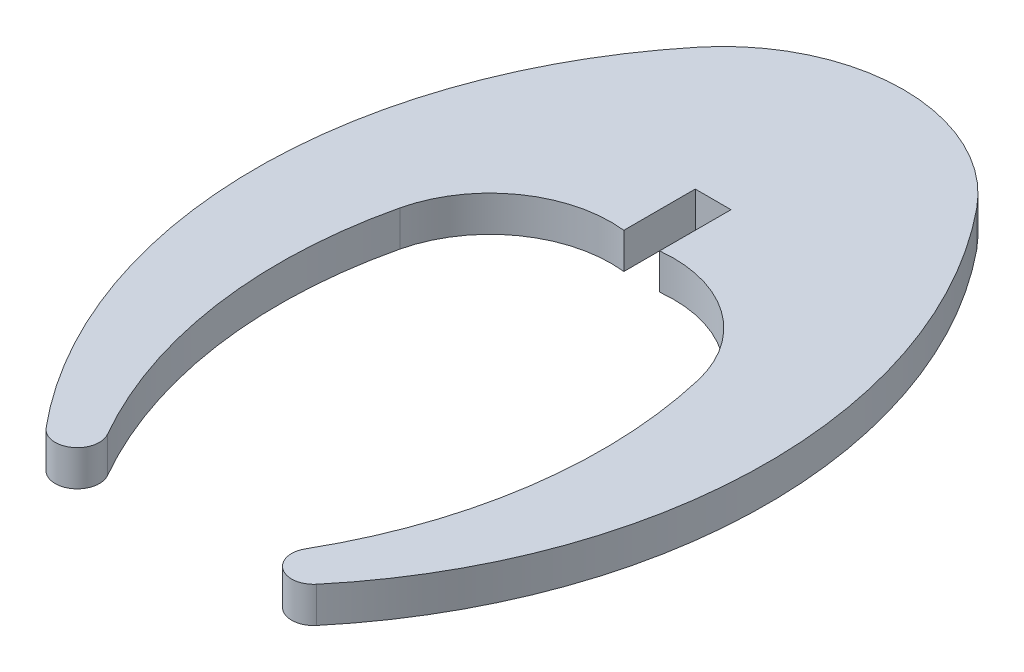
ISO-10303-21;
HEADER;
FILE_DESCRIPTION(('STEP AP214'),'2;1');
FILE_NAME('part.step','',(''),(''),'','','');
FILE_SCHEMA(('AUTOMOTIVE_DESIGN { 1 0 10303 214 1 1 1 1 }'));
ENDSEC;
DATA;
#1=APPLICATION_CONTEXT('core data for automotive mechanical design processes');
#2=APPLICATION_PROTOCOL_DEFINITION('international standard','automotive_design',2000,#1);
#3=PRODUCT_CONTEXT('',#1,'mechanical');
#4=PRODUCT('Part','Part','',(#3));
#5=PRODUCT_RELATED_PRODUCT_CATEGORY('part','',(#4));
#6=PRODUCT_DEFINITION_FORMATION('','',#4);
#7=PRODUCT_DEFINITION_CONTEXT('part definition',#1,'design');
#8=PRODUCT_DEFINITION('design','',#6,#7);
#9=PRODUCT_DEFINITION_SHAPE('','',#8);
#10=(LENGTH_UNIT() NAMED_UNIT(*) SI_UNIT(.MILLI.,.METRE.));
#11=(NAMED_UNIT(*) PLANE_ANGLE_UNIT() SI_UNIT($,.RADIAN.));
#12=(NAMED_UNIT(*) SI_UNIT($,.STERADIAN.) SOLID_ANGLE_UNIT());
#13=UNCERTAINTY_MEASURE_WITH_UNIT(LENGTH_MEASURE(1.E-05),#10,'distance_accuracy_value','');
#14=(GEOMETRIC_REPRESENTATION_CONTEXT(3) GLOBAL_UNCERTAINTY_ASSIGNED_CONTEXT((#13)) GLOBAL_UNIT_ASSIGNED_CONTEXT((#10,
#11,#12)) REPRESENTATION_CONTEXT('',''));
#15=CARTESIAN_POINT('',(0.,0.,0.));
#16=DIRECTION('',(0.,0.,1.));
#17=DIRECTION('',(1.,0.,0.));
#18=AXIS2_PLACEMENT_3D('',#15,#16,#17);
#19=CARTESIAN_POINT('',(-41923.310631,3.,-18307.5707099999));
#20=DIRECTION('',(-0.999999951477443,0.,0.000311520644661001));
#21=DIRECTION('',(0.000311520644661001,0.,0.999999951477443));
#22=AXIS2_PLACEMENT_3D('',#19,#20,#21);
#23=PLANE('',#22);
#24=DIRECTION('',(-0.000311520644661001,0.,-0.999999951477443));
#25=VECTOR('',#24,1.);
#26=CARTESIAN_POINT('',(-41923.310631,0.,-18307.5707099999));
#27=LINE('',#26,#25);
#28=CARTESIAN_POINT('',(-41923.310631,0.,-18307.5707099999));
#29=VERTEX_POINT('',#28);
#30=CARTESIAN_POINT('',(-41923.3125,0.,-18313.570312));
#31=VERTEX_POINT('',#30);
#32=EDGE_CURVE('E156',#29,#31,#27,.T.);
#33=ORIENTED_EDGE('',*,*,#32,.T.);
#34=DIRECTION('',(0.,-1.,0.));
#35=VECTOR('',#34,1.);
#36=CARTESIAN_POINT('',(-41923.3125,3.,-18313.570312));
#37=LINE('',#36,#35);
#38=CARTESIAN_POINT('',(-41923.3125,3.,-18313.570312));
#39=VERTEX_POINT('',#38);
#40=EDGE_CURVE('E11',#39,#31,#37,.T.);
#41=ORIENTED_EDGE('',*,*,#40,.F.);
#42=DIRECTION('',(-0.000311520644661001,0.,-0.999999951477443));
#43=VECTOR('',#42,1.);
#44=CARTESIAN_POINT('',(-41923.310631,3.,-18307.5707099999));
#45=LINE('',#44,#43);
#46=CARTESIAN_POINT('',(-41923.310631,3.,-18307.5707099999));
#47=VERTEX_POINT('',#46);
#48=EDGE_CURVE('E178',#47,#39,#45,.T.);
#49=ORIENTED_EDGE('',*,*,#48,.F.);
#50=DIRECTION('',(0.,-1.,0.));
#51=VECTOR('',#50,1.);
#52=CARTESIAN_POINT('',(-41923.310631,3.,-18307.5707099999));
#53=LINE('',#52,#51);
#54=EDGE_CURVE('E152',#47,#29,#53,.T.);
#55=ORIENTED_EDGE('',*,*,#54,.T.);
#56=EDGE_LOOP('',(#33,#41,#49,#55));
#57=FACE_BOUND('',#56,.T.);
#58=ADVANCED_FACE('F36',(#57),#23,.F.);
#59=CARTESIAN_POINT('',(-41923.3125,3.,-18313.570312));
#60=DIRECTION('',(0.000650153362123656,0.,-0.999999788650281));
#61=DIRECTION('',(-0.999999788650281,0.,-0.000650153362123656));
#62=AXIS2_PLACEMENT_3D('',#59,#60,#61);
#63=PLANE('',#62);
#64=DIRECTION('',(0.99999978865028,0.,0.000650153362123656));
#65=VECTOR('',#64,1.);
#66=CARTESIAN_POINT('',(-41923.3125,0.,-18313.570312));
#67=LINE('',#66,#65);
#68=CARTESIAN_POINT('',(-41920.308594,0.,-18313.568359));
#69=VERTEX_POINT('',#68);
#70=EDGE_CURVE('E159',#31,#69,#67,.T.);
#71=ORIENTED_EDGE('',*,*,#70,.T.);
#72=DIRECTION('',(0.,-1.,0.));
#73=VECTOR('',#72,1.);
#74=CARTESIAN_POINT('',(-41920.308594,3.,-18313.568359));
#75=LINE('',#74,#73);
#76=CARTESIAN_POINT('',(-41920.308594,3.,-18313.568359));
#77=VERTEX_POINT('',#76);
#78=EDGE_CURVE('E44',#77,#69,#75,.T.);
#79=ORIENTED_EDGE('',*,*,#78,.F.);
#80=DIRECTION('',(0.99999978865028,0.,0.000650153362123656));
#81=VECTOR('',#80,1.);
#82=CARTESIAN_POINT('',(-41923.3125,3.,-18313.570312));
#83=LINE('',#82,#81);
#84=EDGE_CURVE('E107',#39,#77,#83,.T.);
#85=ORIENTED_EDGE('',*,*,#84,.F.);
#86=ORIENTED_EDGE('',*,*,#40,.T.);
#87=EDGE_LOOP('',(#71,#79,#85,#86));
#88=FACE_BOUND('',#87,.T.);
#89=ADVANCED_FACE('F256',(#88),#63,.F.);
#90=CARTESIAN_POINT('',(-41920.308594,3.,-18313.568359));
#91=DIRECTION('',(0.999999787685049,0.,0.00065163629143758));
#92=DIRECTION('',(0.00065163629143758,0.,-0.999999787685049));
#93=AXIS2_PLACEMENT_3D('',#90,#91,#92);
#94=PLANE('',#93);
#95=DIRECTION('',(-0.00065163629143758,0.,0.999999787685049));
#96=VECTOR('',#95,1.);
#97=CARTESIAN_POINT('',(-41920.308594,0.,-18313.568359));
#98=LINE('',#97,#96);
#99=CARTESIAN_POINT('',(-41920.3125,0.,-18307.574219));
#100=VERTEX_POINT('',#99);
#101=EDGE_CURVE('E161',#69,#100,#98,.T.);
#102=ORIENTED_EDGE('',*,*,#101,.T.);
#103=DIRECTION('',(0.,-1.,0.));
#104=VECTOR('',#103,1.);
#105=CARTESIAN_POINT('',(-41920.3125,3.,-18307.574219));
#106=LINE('',#105,#104);
#107=CARTESIAN_POINT('',(-41920.3125,3.,-18307.574219));
#108=VERTEX_POINT('',#107);
#109=EDGE_CURVE('E197',#108,#100,#106,.T.);
#110=ORIENTED_EDGE('',*,*,#109,.F.);
#111=DIRECTION('',(-0.00065163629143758,0.,0.999999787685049));
#112=VECTOR('',#111,1.);
#113=CARTESIAN_POINT('',(-41920.308594,3.,-18313.568359));
#114=LINE('',#113,#112);
#115=EDGE_CURVE('E205',#77,#108,#114,.T.);
#116=ORIENTED_EDGE('',*,*,#115,.F.);
#117=ORIENTED_EDGE('',*,*,#78,.T.);
#118=EDGE_LOOP('',(#102,#110,#116,#117));
#119=FACE_BOUND('',#118,.T.);
#120=ADVANCED_FACE('F203',(#119),#94,.F.);
#121=CARTESIAN_POINT('',(-41919.1911014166,3.,-18297.4693434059));
#122=DIRECTION('',(0.,-1.,0.));
#123=DIRECTION('',(0.,0.,-1.));
#124=AXIS2_PLACEMENT_3D('',#121,#122,#123);
#125=CYLINDRICAL_SURFACE('',#124,10.1669093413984);
#126=CARTESIAN_POINT('',(-41919.1911014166,0.,-18297.4693434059));
#127=DIRECTION('',(0.,-1.,0.));
#128=DIRECTION('',(0.,0.,1.));
#129=AXIS2_PLACEMENT_3D('',#126,#127,#128);
#130=CIRCLE('',#129,10.1669093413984);
#131=CARTESIAN_POINT('',(-41909.2904880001,0.,-18299.781031));
#132=VERTEX_POINT('',#131);
#133=EDGE_CURVE('E163',#100,#132,#130,.T.);
#134=ORIENTED_EDGE('',*,*,#133,.T.);
#135=DIRECTION('',(0.,-1.,0.));
#136=VECTOR('',#135,1.);
#137=CARTESIAN_POINT('',(-41909.2904880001,3.,-18299.781031));
#138=LINE('',#137,#136);
#139=CARTESIAN_POINT('',(-41909.2904880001,3.,-18299.781031));
#140=VERTEX_POINT('',#139);
#141=EDGE_CURVE('E194',#140,#132,#138,.T.);
#142=ORIENTED_EDGE('',*,*,#141,.F.);
#143=CARTESIAN_POINT('',(-41919.1911014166,3.,-18297.4693434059));
#144=DIRECTION('',(0.,-1.,0.));
#145=DIRECTION('',(0.,0.,1.));
#146=AXIS2_PLACEMENT_3D('',#143,#144,#145);
#147=CIRCLE('',#146,10.1669093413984);
#148=EDGE_CURVE('E223',#108,#140,#147,.T.);
#149=ORIENTED_EDGE('',*,*,#148,.F.);
#150=ORIENTED_EDGE('',*,*,#109,.T.);
#151=EDGE_LOOP('',(#134,#142,#149,#150));
#152=FACE_BOUND('',#151,.T.);
#153=ADVANCED_FACE('F214',(#152),#125,.F.);
#154=CARTESIAN_POINT('',(-41947.8406722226,3.,-18290.7599826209));
#155=DIRECTION('',(0.,-1.,0.));
#156=DIRECTION('',(0.,0.,-1.));
#157=AXIS2_PLACEMENT_3D('',#154,#155,#156);
#158=CYLINDRICAL_SURFACE('',#157,39.5916154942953);
#159=CARTESIAN_POINT('',(-41947.8406722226,0.,-18290.7599826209));
#160=DIRECTION('',(0.,-1.,0.));
#161=DIRECTION('',(0.,0.,1.));
#162=AXIS2_PLACEMENT_3D('',#159,#160,#161);
#163=CIRCLE('',#162,39.5916154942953);
#164=CARTESIAN_POINT('',(-41913.5091370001,0.,-18271.040913));
#165=VERTEX_POINT('',#164);
#166=EDGE_CURVE('E165',#132,#165,#163,.T.);
#167=ORIENTED_EDGE('',*,*,#166,.T.);
#168=DIRECTION('',(0.,-1.,0.));
#169=VECTOR('',#168,1.);
#170=CARTESIAN_POINT('',(-41913.5091370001,3.,-18271.040913));
#171=LINE('',#170,#169);
#172=CARTESIAN_POINT('',(-41913.5091370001,3.,-18271.040913));
#173=VERTEX_POINT('',#172);
#174=EDGE_CURVE('E191',#173,#165,#171,.T.);
#175=ORIENTED_EDGE('',*,*,#174,.F.);
#176=CARTESIAN_POINT('',(-41947.8406722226,3.,-18290.7599826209));
#177=DIRECTION('',(0.,-1.,0.));
#178=DIRECTION('',(0.,0.,1.));
#179=AXIS2_PLACEMENT_3D('',#176,#177,#178);
#180=CIRCLE('',#179,39.5916154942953);
#181=EDGE_CURVE('E220',#140,#173,#180,.T.);
#182=ORIENTED_EDGE('',*,*,#181,.F.);
#183=ORIENTED_EDGE('',*,*,#141,.T.);
#184=EDGE_LOOP('',(#167,#175,#182,#183));
#185=FACE_BOUND('',#184,.T.);
#186=ADVANCED_FACE('F218',(#185),#158,.F.);
#187=CARTESIAN_POINT('',(-41911.8973565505,3.,-18270.1164332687));
#188=DIRECTION('',(0.,-1.,0.));
#189=DIRECTION('',(0.,0.,-1.));
#190=AXIS2_PLACEMENT_3D('',#187,#188,#189);
#191=CYLINDRICAL_SURFACE('',#190,1.85809014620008);
#192=CARTESIAN_POINT('',(-41911.8973565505,0.,-18270.1164332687));
#193=DIRECTION('',(0.,1.,0.));
#194=DIRECTION('',(0.,0.,1.));
#195=AXIS2_PLACEMENT_3D('',#192,#193,#194);
#196=CIRCLE('',#195,1.85809014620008);
#197=CARTESIAN_POINT('',(-41910.473192,0.,-18268.923012));
#198=VERTEX_POINT('',#197);
#199=EDGE_CURVE('E167',#165,#198,#196,.T.);
#200=ORIENTED_EDGE('',*,*,#199,.T.);
#201=DIRECTION('',(0.,-1.,0.));
#202=VECTOR('',#201,1.);
#203=CARTESIAN_POINT('',(-41910.473192,3.,-18268.923012));
#204=LINE('',#203,#202);
#205=CARTESIAN_POINT('',(-41910.473192,3.,-18268.923012));
#206=VERTEX_POINT('',#205);
#207=EDGE_CURVE('E188',#206,#198,#204,.T.);
#208=ORIENTED_EDGE('',*,*,#207,.F.);
#209=CARTESIAN_POINT('',(-41911.8973565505,3.,-18270.1164332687));
#210=DIRECTION('',(0.,1.,0.));
#211=DIRECTION('',(0.,0.,1.));
#212=AXIS2_PLACEMENT_3D('',#209,#210,#211);
#213=CIRCLE('',#212,1.85809014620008);
#214=EDGE_CURVE('E222',#173,#206,#213,.T.);
#215=ORIENTED_EDGE('',*,*,#214,.F.);
#216=ORIENTED_EDGE('',*,*,#174,.T.);
#217=EDGE_LOOP('',(#200,#208,#215,#216));
#218=FACE_BOUND('',#217,.T.);
#219=ADVANCED_FACE('F269',(#218),#191,.T.);
#220=CARTESIAN_POINT('',(-41943.5859328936,3.,-18296.6861208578));
#221=DIRECTION('',(0.,-1.,0.));
#222=DIRECTION('',(0.,0.,-1.));
#223=AXIS2_PLACEMENT_3D('',#220,#221,#222);
#224=CYLINDRICAL_SURFACE('',#223,43.2116167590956);
#225=CARTESIAN_POINT('',(-41943.5859328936,0.,-18296.6861208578));
#226=DIRECTION('',(0.,1.,0.));
#227=DIRECTION('',(0.,0.,1.));
#228=AXIS2_PLACEMENT_3D('',#225,#226,#227);
#229=CIRCLE('',#228,43.2116167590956);
#230=CARTESIAN_POINT('',(-41910.079274,0.,-18323.972521));
#231=VERTEX_POINT('',#230);
#232=EDGE_CURVE('E169',#198,#231,#229,.T.);
#233=ORIENTED_EDGE('',*,*,#232,.T.);
#234=DIRECTION('',(0.,-1.,0.));
#235=VECTOR('',#234,1.);
#236=CARTESIAN_POINT('',(-41910.079274,3.,-18323.972521));
#237=LINE('',#236,#235);
#238=CARTESIAN_POINT('',(-41910.079274,3.,-18323.972521));
#239=VERTEX_POINT('',#238);
#240=EDGE_CURVE('E185',#239,#231,#237,.T.);
#241=ORIENTED_EDGE('',*,*,#240,.F.);
#242=CARTESIAN_POINT('',(-41943.5859328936,3.,-18296.6861208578));
#243=DIRECTION('',(0.,1.,0.));
#244=DIRECTION('',(0.,0.,1.));
#245=AXIS2_PLACEMENT_3D('',#242,#243,#244);
#246=CIRCLE('',#245,43.2116167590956);
#247=EDGE_CURVE('E225',#206,#239,#246,.T.);
#248=ORIENTED_EDGE('',*,*,#247,.F.);
#249=ORIENTED_EDGE('',*,*,#207,.T.);
#250=EDGE_LOOP('',(#233,#241,#248,#249));
#251=FACE_BOUND('',#250,.T.);
#252=ADVANCED_FACE('F272',(#251),#224,.T.);
#253=CARTESIAN_POINT('',(-41921.8088364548,3.,-18314.4179691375));
#254=DIRECTION('',(0.,-1.,0.));
#255=DIRECTION('',(0.,0.,-1.));
#256=AXIS2_PLACEMENT_3D('',#253,#254,#255);
#257=CYLINDRICAL_SURFACE('',#256,15.1285193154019);
#258=CARTESIAN_POINT('',(-41921.8088364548,0.,-18314.4179691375));
#259=DIRECTION('',(0.,1.,0.));
#260=DIRECTION('',(0.,0.,1.));
#261=AXIS2_PLACEMENT_3D('',#258,#259,#260);
#262=CIRCLE('',#261,15.1285193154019);
#263=CARTESIAN_POINT('',(-41933.528271,0.,-18323.984941));
#264=VERTEX_POINT('',#263);
#265=EDGE_CURVE('E171',#231,#264,#262,.T.);
#266=ORIENTED_EDGE('',*,*,#265,.T.);
#267=DIRECTION('',(0.,-1.,0.));
#268=VECTOR('',#267,1.);
#269=CARTESIAN_POINT('',(-41933.528271,3.,-18323.984941));
#270=LINE('',#269,#268);
#271=CARTESIAN_POINT('',(-41933.528271,3.,-18323.984941));
#272=VERTEX_POINT('',#271);
#273=EDGE_CURVE('E182',#272,#264,#270,.T.);
#274=ORIENTED_EDGE('',*,*,#273,.F.);
#275=CARTESIAN_POINT('',(-41921.8088364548,3.,-18314.4179691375));
#276=DIRECTION('',(0.,1.,0.));
#277=DIRECTION('',(0.,0.,1.));
#278=AXIS2_PLACEMENT_3D('',#275,#276,#277);
#279=CIRCLE('',#278,15.1285193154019);
#280=EDGE_CURVE('E231',#239,#272,#279,.T.);
#281=ORIENTED_EDGE('',*,*,#280,.F.);
#282=ORIENTED_EDGE('',*,*,#240,.T.);
#283=EDGE_LOOP('',(#266,#274,#281,#282));
#284=FACE_BOUND('',#283,.T.);
#285=ADVANCED_FACE('F237',(#284),#257,.T.);
#286=CARTESIAN_POINT('',(-41900.0507753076,3.,-18296.6631295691));
#287=DIRECTION('',(0.,-1.,0.));
#288=DIRECTION('',(0.,0.,-1.));
#289=AXIS2_PLACEMENT_3D('',#286,#287,#288);
#290=CYLINDRICAL_SURFACE('',#289,43.2113885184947);
#291=CARTESIAN_POINT('',(-41900.0507753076,0.,-18296.6631295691));
#292=DIRECTION('',(0.,1.,0.));
#293=DIRECTION('',(0.,0.,1.));
#294=AXIS2_PLACEMENT_3D('',#291,#292,#293);
#295=CIRCLE('',#294,43.2113885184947);
#296=CARTESIAN_POINT('',(-41933.192194,0.,-18268.9346159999));
#297=VERTEX_POINT('',#296);
#298=EDGE_CURVE('E173',#264,#297,#295,.T.);
#299=ORIENTED_EDGE('',*,*,#298,.T.);
#300=DIRECTION('',(0.,-1.,0.));
#301=VECTOR('',#300,1.);
#302=CARTESIAN_POINT('',(-41933.192194,3.,-18268.9346159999));
#303=LINE('',#302,#301);
#304=CARTESIAN_POINT('',(-41933.192194,3.,-18268.9346159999));
#305=VERTEX_POINT('',#304);
#306=EDGE_CURVE('E147',#305,#297,#303,.T.);
#307=ORIENTED_EDGE('',*,*,#306,.F.);
#308=CARTESIAN_POINT('',(-41900.0507753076,3.,-18296.6631295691));
#309=DIRECTION('',(0.,1.,0.));
#310=DIRECTION('',(0.,0.,1.));
#311=AXIS2_PLACEMENT_3D('',#308,#309,#310);
#312=CIRCLE('',#311,43.2113885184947);
#313=EDGE_CURVE('E138',#272,#305,#312,.T.);
#314=ORIENTED_EDGE('',*,*,#313,.F.);
#315=ORIENTED_EDGE('',*,*,#273,.T.);
#316=EDGE_LOOP('',(#299,#307,#314,#315));
#317=FACE_BOUND('',#316,.T.);
#318=ADVANCED_FACE('F241',(#317),#290,.T.);
#319=CARTESIAN_POINT('',(-41931.7650409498,3.,-18270.1254058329));
#320=DIRECTION('',(0.,-1.,0.));
#321=DIRECTION('',(0.,0.,-1.));
#322=AXIS2_PLACEMENT_3D('',#319,#320,#321);
#323=CYLINDRICAL_SURFACE('',#322,1.85869477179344);
#324=CARTESIAN_POINT('',(-41931.7650409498,0.,-18270.1254058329));
#325=DIRECTION('',(0.,1.,0.));
#326=DIRECTION('',(0.,0.,1.));
#327=AXIS2_PLACEMENT_3D('',#324,#325,#326);
#328=CIRCLE('',#327,1.85869477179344);
#329=CARTESIAN_POINT('',(-41930.151273,0.,-18271.047631));
#330=VERTEX_POINT('',#329);
#331=EDGE_CURVE('E146',#297,#330,#328,.T.);
#332=ORIENTED_EDGE('',*,*,#331,.T.);
#333=DIRECTION('',(0.,-1.,0.));
#334=VECTOR('',#333,1.);
#335=CARTESIAN_POINT('',(-41930.151273,3.,-18271.047631));
#336=LINE('',#335,#334);
#337=CARTESIAN_POINT('',(-41930.151273,3.,-18271.047631));
#338=VERTEX_POINT('',#337);
#339=EDGE_CURVE('E143',#338,#330,#336,.T.);
#340=ORIENTED_EDGE('',*,*,#339,.F.);
#341=CARTESIAN_POINT('',(-41931.7650409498,3.,-18270.1254058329));
#342=DIRECTION('',(0.,1.,0.));
#343=DIRECTION('',(0.,0.,1.));
#344=AXIS2_PLACEMENT_3D('',#341,#342,#343);
#345=CIRCLE('',#344,1.85869477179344);
#346=EDGE_CURVE('E132',#305,#338,#345,.T.);
#347=ORIENTED_EDGE('',*,*,#346,.F.);
#348=ORIENTED_EDGE('',*,*,#306,.T.);
#349=EDGE_LOOP('',(#332,#340,#347,#348));
#350=FACE_BOUND('',#349,.T.);
#351=ADVANCED_FACE('F144',(#350),#323,.T.);
#352=CARTESIAN_POINT('',(-41895.8007405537,3.,-18290.7380037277));
#353=DIRECTION('',(0.,-1.,0.));
#354=DIRECTION('',(0.,0.,-1.));
#355=AXIS2_PLACEMENT_3D('',#352,#353,#354);
#356=CYLINDRICAL_SURFACE('',#355,39.5938108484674);
#357=CARTESIAN_POINT('',(-41895.8007405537,0.,-18290.7380037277));
#358=DIRECTION('',(0.,-1.,0.));
#359=DIRECTION('',(0.,0.,1.));
#360=AXIS2_PLACEMENT_3D('',#357,#358,#359);
#361=CIRCLE('',#360,39.5938108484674);
#362=CARTESIAN_POINT('',(-41934.344733,0.,-18299.795073));
#363=VERTEX_POINT('',#362);
#364=EDGE_CURVE('E93',#330,#363,#361,.T.);
#365=ORIENTED_EDGE('',*,*,#364,.T.);
#366=DIRECTION('',(0.,-1.,0.));
#367=VECTOR('',#366,1.);
#368=CARTESIAN_POINT('',(-41934.344733,3.,-18299.795073));
#369=LINE('',#368,#367);
#370=CARTESIAN_POINT('',(-41934.344733,3.,-18299.795073));
#371=VERTEX_POINT('',#370);
#372=EDGE_CURVE('E148',#371,#363,#369,.T.);
#373=ORIENTED_EDGE('',*,*,#372,.F.);
#374=CARTESIAN_POINT('',(-41895.8007405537,3.,-18290.7380037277));
#375=DIRECTION('',(0.,-1.,0.));
#376=DIRECTION('',(0.,0.,1.));
#377=AXIS2_PLACEMENT_3D('',#374,#375,#376);
#378=CIRCLE('',#377,39.5938108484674);
#379=EDGE_CURVE('E136',#338,#371,#378,.T.);
#380=ORIENTED_EDGE('',*,*,#379,.F.);
#381=ORIENTED_EDGE('',*,*,#339,.T.);
#382=EDGE_LOOP('',(#365,#373,#380,#381));
#383=FACE_BOUND('',#382,.T.);
#384=ADVANCED_FACE('F150',(#383),#356,.F.);
#385=CARTESIAN_POINT('',(-41924.4497449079,3.,-18297.4703323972));
#386=DIRECTION('',(0.,-1.,0.));
#387=DIRECTION('',(0.,0.,-1.));
#388=AXIS2_PLACEMENT_3D('',#385,#386,#387);
#389=CYLINDRICAL_SURFACE('',#388,10.1644088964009);
#390=CARTESIAN_POINT('',(-41924.4497449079,0.,-18297.4703323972));
#391=DIRECTION('',(0.,-1.,0.));
#392=DIRECTION('',(0.,0.,1.));
#393=AXIS2_PLACEMENT_3D('',#390,#391,#392);
#394=CIRCLE('',#393,10.1644088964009);
#395=EDGE_CURVE('E99',#363,#29,#394,.T.);
#396=ORIENTED_EDGE('',*,*,#395,.T.);
#397=ORIENTED_EDGE('',*,*,#54,.F.);
#398=CARTESIAN_POINT('',(-41924.4497449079,3.,-18297.4703323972));
#399=DIRECTION('',(0.,-1.,0.));
#400=DIRECTION('',(0.,0.,1.));
#401=AXIS2_PLACEMENT_3D('',#398,#399,#400);
#402=CIRCLE('',#401,10.1644088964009);
#403=EDGE_CURVE('E52',#371,#47,#402,.T.);
#404=ORIENTED_EDGE('',*,*,#403,.F.);
#405=ORIENTED_EDGE('',*,*,#372,.T.);
#406=EDGE_LOOP('',(#396,#397,#404,#405));
#407=FACE_BOUND('',#406,.T.);
#408=ADVANCED_FACE('F245',(#407),#389,.F.);
#409=CARTESIAN_POINT('',(-41919.1911014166,3.,-18297.4693434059));
#410=DIRECTION('',(0.,1.,0.));
#411=DIRECTION('',(0.,0.,1.));
#412=AXIS2_PLACEMENT_3D('',#409,#410,#411);
#413=PLANE('',#412);
#414=ORIENTED_EDGE('',*,*,#48,.T.);
#415=ORIENTED_EDGE('',*,*,#84,.T.);
#416=ORIENTED_EDGE('',*,*,#115,.T.);
#417=ORIENTED_EDGE('',*,*,#148,.T.);
#418=ORIENTED_EDGE('',*,*,#181,.T.);
#419=ORIENTED_EDGE('',*,*,#214,.T.);
#420=ORIENTED_EDGE('',*,*,#247,.T.);
#421=ORIENTED_EDGE('',*,*,#280,.T.);
#422=ORIENTED_EDGE('',*,*,#313,.T.);
#423=ORIENTED_EDGE('',*,*,#346,.T.);
#424=ORIENTED_EDGE('',*,*,#379,.T.);
#425=ORIENTED_EDGE('',*,*,#403,.T.);
#426=EDGE_LOOP('',(#414,#415,#416,#417,#418,#419,#420,#421,#422,#423,#424,#425));
#427=FACE_BOUND('',#426,.T.);
#428=ADVANCED_FACE('F134',(#427),#413,.T.);
#429=CARTESIAN_POINT('',(-41919.1911014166,0.,-18297.4693434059));
#430=DIRECTION('',(0.,1.,0.));
#431=DIRECTION('',(0.,0.,1.));
#432=AXIS2_PLACEMENT_3D('',#429,#430,#431);
#433=PLANE('',#432);
#434=ORIENTED_EDGE('',*,*,#32,.F.);
#435=ORIENTED_EDGE('',*,*,#395,.F.);
#436=ORIENTED_EDGE('',*,*,#364,.F.);
#437=ORIENTED_EDGE('',*,*,#331,.F.);
#438=ORIENTED_EDGE('',*,*,#298,.F.);
#439=ORIENTED_EDGE('',*,*,#265,.F.);
#440=ORIENTED_EDGE('',*,*,#232,.F.);
#441=ORIENTED_EDGE('',*,*,#199,.F.);
#442=ORIENTED_EDGE('',*,*,#166,.F.);
#443=ORIENTED_EDGE('',*,*,#133,.F.);
#444=ORIENTED_EDGE('',*,*,#101,.F.);
#445=ORIENTED_EDGE('',*,*,#70,.F.);
#446=EDGE_LOOP('',(#434,#435,#436,#437,#438,#439,#440,#441,#442,#443,#444,#445));
#447=FACE_BOUND('',#446,.T.);
#448=ADVANCED_FACE('F209',(#447),#433,.F.);
#449=CLOSED_SHELL('',(#58,#89,#120,#153,#186,#219,#252,#285,#318,#351,#384,#408,#428,#448));
#450=MANIFOLD_SOLID_BREP('B2',#449);
#451=ADVANCED_BREP_SHAPE_REPRESENTATION('',(#18,#450),#14);
#452=SHAPE_DEFINITION_REPRESENTATION(#9,#451);
ENDSEC;
END-ISO-10303-21;
